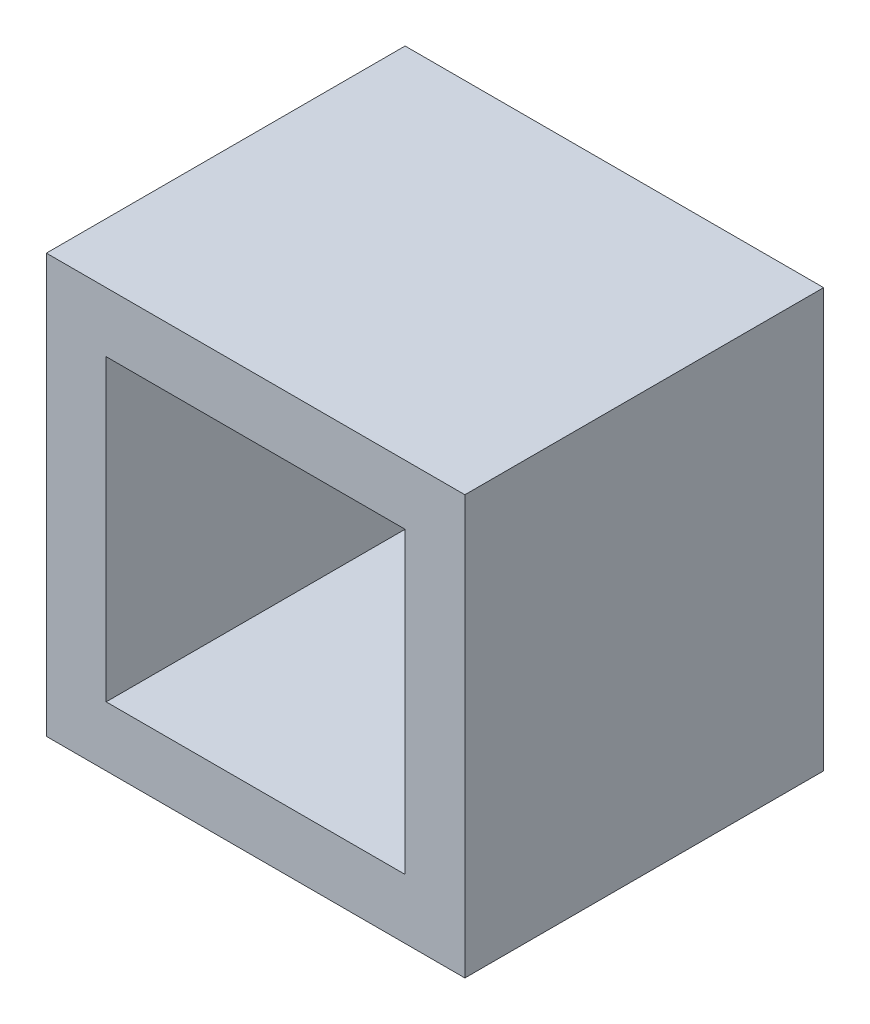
ISO-10303-21;
HEADER;
FILE_DESCRIPTION(('STEP AP214'),'2;1');
FILE_NAME('part.step','',(''),(''),'','','');
FILE_SCHEMA(('AUTOMOTIVE_DESIGN { 1 0 10303 214 1 1 1 1 }'));
ENDSEC;
DATA;
#1=APPLICATION_CONTEXT('core data for automotive mechanical design processes');
#2=APPLICATION_PROTOCOL_DEFINITION('international standard','automotive_design',2000,#1);
#3=PRODUCT_CONTEXT('',#1,'mechanical');
#4=PRODUCT('Part','Part','',(#3));
#5=PRODUCT_RELATED_PRODUCT_CATEGORY('part','',(#4));
#6=PRODUCT_DEFINITION_FORMATION('','',#4);
#7=PRODUCT_DEFINITION_CONTEXT('part definition',#1,'design');
#8=PRODUCT_DEFINITION('design','',#6,#7);
#9=PRODUCT_DEFINITION_SHAPE('','',#8);
#10=(LENGTH_UNIT() NAMED_UNIT(*) SI_UNIT(.MILLI.,.METRE.));
#11=(NAMED_UNIT(*) PLANE_ANGLE_UNIT() SI_UNIT($,.RADIAN.));
#12=(NAMED_UNIT(*) SI_UNIT($,.STERADIAN.) SOLID_ANGLE_UNIT());
#13=UNCERTAINTY_MEASURE_WITH_UNIT(LENGTH_MEASURE(1.E-05),#10,'distance_accuracy_value','');
#14=(GEOMETRIC_REPRESENTATION_CONTEXT(3) GLOBAL_UNCERTAINTY_ASSIGNED_CONTEXT((#13)) GLOBAL_UNIT_ASSIGNED_CONTEXT((#10,
#11,#12)) REPRESENTATION_CONTEXT('',''));
#15=CARTESIAN_POINT('',(0.,0.,0.));
#16=DIRECTION('',(0.,0.,1.));
#17=DIRECTION('',(1.,0.,0.));
#18=AXIS2_PLACEMENT_3D('',#15,#16,#17);
#19=CARTESIAN_POINT('',(0.,0.,60.));
#20=DIRECTION('',(0.,0.,1.));
#21=DIRECTION('',(1.,0.,0.));
#22=AXIS2_PLACEMENT_3D('',#19,#20,#21);
#23=PLANE('',#22);
#24=DIRECTION('',(0.,-1.,0.));
#25=VECTOR('',#24,1.);
#26=CARTESIAN_POINT('',(-35.,-35.,60.));
#27=LINE('',#26,#25);
#28=CARTESIAN_POINT('',(-35.,35.,60.));
#29=VERTEX_POINT('',#28);
#30=CARTESIAN_POINT('',(-35.,-35.,60.));
#31=VERTEX_POINT('',#30);
#32=EDGE_CURVE('E134',#29,#31,#27,.T.);
#33=ORIENTED_EDGE('',*,*,#32,.T.);
#34=DIRECTION('',(1.,0.,0.));
#35=VECTOR('',#34,1.);
#36=CARTESIAN_POINT('',(35.,-35.,60.));
#37=LINE('',#36,#35);
#38=CARTESIAN_POINT('',(35.,-35.,60.));
#39=VERTEX_POINT('',#38);
#40=EDGE_CURVE('E137',#31,#39,#37,.T.);
#41=ORIENTED_EDGE('',*,*,#40,.T.);
#42=DIRECTION('',(0.,1.,0.));
#43=VECTOR('',#42,1.);
#44=CARTESIAN_POINT('',(35.,-35.,60.));
#45=LINE('',#44,#43);
#46=CARTESIAN_POINT('',(35.,35.,60.));
#47=VERTEX_POINT('',#46);
#48=EDGE_CURVE('E140',#39,#47,#45,.T.);
#49=ORIENTED_EDGE('',*,*,#48,.T.);
#50=DIRECTION('',(-1.,0.,0.));
#51=VECTOR('',#50,1.);
#52=CARTESIAN_POINT('',(35.,35.,60.));
#53=LINE('',#52,#51);
#54=EDGE_CURVE('E142',#47,#29,#53,.T.);
#55=ORIENTED_EDGE('',*,*,#54,.T.);
#56=EDGE_LOOP('',(#33,#41,#49,#55));
#57=FACE_BOUND('',#56,.T.);
#58=DIRECTION('',(1.,0.,0.));
#59=VECTOR('',#58,1.);
#60=CARTESIAN_POINT('',(25.,-25.,60.));
#61=LINE('',#60,#59);
#62=CARTESIAN_POINT('',(-25.,-25.,60.));
#63=VERTEX_POINT('',#62);
#64=CARTESIAN_POINT('',(25.,-25.,60.));
#65=VERTEX_POINT('',#64);
#66=EDGE_CURVE('E106',#63,#65,#61,.T.);
#67=ORIENTED_EDGE('',*,*,#66,.F.);
#68=DIRECTION('',(0.,-1.,0.));
#69=VECTOR('',#68,1.);
#70=CARTESIAN_POINT('',(-25.,-25.,60.));
#71=LINE('',#70,#69);
#72=CARTESIAN_POINT('',(-25.,25.,60.));
#73=VERTEX_POINT('',#72);
#74=EDGE_CURVE('E98',#73,#63,#71,.T.);
#75=ORIENTED_EDGE('',*,*,#74,.F.);
#76=DIRECTION('',(-1.,0.,0.));
#77=VECTOR('',#76,1.);
#78=CARTESIAN_POINT('',(25.,25.,60.));
#79=LINE('',#78,#77);
#80=CARTESIAN_POINT('',(25.,25.,60.));
#81=VERTEX_POINT('',#80);
#82=EDGE_CURVE('E120',#81,#73,#79,.T.);
#83=ORIENTED_EDGE('',*,*,#82,.F.);
#84=DIRECTION('',(0.,1.,0.));
#85=VECTOR('',#84,1.);
#86=CARTESIAN_POINT('',(25.,-25.,60.));
#87=LINE('',#86,#85);
#88=EDGE_CURVE('E118',#65,#81,#87,.T.);
#89=ORIENTED_EDGE('',*,*,#88,.F.);
#90=EDGE_LOOP('',(#67,#75,#83,#89));
#91=FACE_BOUND('',#90,.T.);
#92=ADVANCED_FACE('F33',(#57,#91),#23,.T.);
#93=CARTESIAN_POINT('',(0.,0.,0.));
#94=DIRECTION('',(0.,0.,1.));
#95=DIRECTION('',(1.,0.,0.));
#96=AXIS2_PLACEMENT_3D('',#93,#94,#95);
#97=PLANE('',#96);
#98=DIRECTION('',(0.,-1.,0.));
#99=VECTOR('',#98,1.);
#100=CARTESIAN_POINT('',(-35.,-35.,0.));
#101=LINE('',#100,#99);
#102=CARTESIAN_POINT('',(-35.,35.,0.));
#103=VERTEX_POINT('',#102);
#104=CARTESIAN_POINT('',(-35.,-35.,0.));
#105=VERTEX_POINT('',#104);
#106=EDGE_CURVE('E114',#103,#105,#101,.T.);
#107=ORIENTED_EDGE('',*,*,#106,.F.);
#108=DIRECTION('',(-1.,0.,0.));
#109=VECTOR('',#108,1.);
#110=CARTESIAN_POINT('',(35.,35.,0.));
#111=LINE('',#110,#109);
#112=CARTESIAN_POINT('',(35.,35.,0.));
#113=VERTEX_POINT('',#112);
#114=EDGE_CURVE('E138',#113,#103,#111,.T.);
#115=ORIENTED_EDGE('',*,*,#114,.F.);
#116=DIRECTION('',(0.,1.,0.));
#117=VECTOR('',#116,1.);
#118=CARTESIAN_POINT('',(35.,-35.,0.));
#119=LINE('',#118,#117);
#120=CARTESIAN_POINT('',(35.,-35.,0.));
#121=VERTEX_POINT('',#120);
#122=EDGE_CURVE('E149',#121,#113,#119,.T.);
#123=ORIENTED_EDGE('',*,*,#122,.F.);
#124=DIRECTION('',(1.,0.,0.));
#125=VECTOR('',#124,1.);
#126=CARTESIAN_POINT('',(35.,-35.,0.));
#127=LINE('',#126,#125);
#128=EDGE_CURVE('E147',#105,#121,#127,.T.);
#129=ORIENTED_EDGE('',*,*,#128,.F.);
#130=EDGE_LOOP('',(#107,#115,#123,#129));
#131=FACE_BOUND('',#130,.T.);
#132=DIRECTION('',(0.,-1.,0.));
#133=VECTOR('',#132,1.);
#134=CARTESIAN_POINT('',(-25.,-25.,0.));
#135=LINE('',#134,#133);
#136=CARTESIAN_POINT('',(-25.,25.,0.));
#137=VERTEX_POINT('',#136);
#138=CARTESIAN_POINT('',(-25.,-25.,0.));
#139=VERTEX_POINT('',#138);
#140=EDGE_CURVE('E56',#137,#139,#135,.T.);
#141=ORIENTED_EDGE('',*,*,#140,.T.);
#142=DIRECTION('',(1.,0.,0.));
#143=VECTOR('',#142,1.);
#144=CARTESIAN_POINT('',(25.,-25.,0.));
#145=LINE('',#144,#143);
#146=CARTESIAN_POINT('',(25.,-25.,0.));
#147=VERTEX_POINT('',#146);
#148=EDGE_CURVE('E113',#139,#147,#145,.T.);
#149=ORIENTED_EDGE('',*,*,#148,.T.);
#150=DIRECTION('',(0.,1.,0.));
#151=VECTOR('',#150,1.);
#152=CARTESIAN_POINT('',(25.,-25.,0.));
#153=LINE('',#152,#151);
#154=CARTESIAN_POINT('',(25.,25.,0.));
#155=VERTEX_POINT('',#154);
#156=EDGE_CURVE('E126',#147,#155,#153,.T.);
#157=ORIENTED_EDGE('',*,*,#156,.T.);
#158=DIRECTION('',(-1.,0.,0.));
#159=VECTOR('',#158,1.);
#160=CARTESIAN_POINT('',(25.,25.,0.));
#161=LINE('',#160,#159);
#162=EDGE_CURVE('E107',#155,#137,#161,.T.);
#163=ORIENTED_EDGE('',*,*,#162,.T.);
#164=EDGE_LOOP('',(#141,#149,#157,#163));
#165=FACE_BOUND('',#164,.T.);
#166=ADVANCED_FACE('F167',(#131,#165),#97,.F.);
#167=CARTESIAN_POINT('',(-35.,-35.,60.));
#168=DIRECTION('',(1.,0.,0.));
#169=DIRECTION('',(0.,0.,-1.));
#170=AXIS2_PLACEMENT_3D('',#167,#168,#169);
#171=PLANE('',#170);
#172=ORIENTED_EDGE('',*,*,#106,.T.);
#173=DIRECTION('',(0.,0.,-1.));
#174=VECTOR('',#173,1.);
#175=CARTESIAN_POINT('',(-35.,-35.,60.));
#176=LINE('',#175,#174);
#177=EDGE_CURVE('E11',#31,#105,#176,.T.);
#178=ORIENTED_EDGE('',*,*,#177,.F.);
#179=ORIENTED_EDGE('',*,*,#32,.F.);
#180=DIRECTION('',(0.,0.,-1.));
#181=VECTOR('',#180,1.);
#182=CARTESIAN_POINT('',(-35.,35.,60.));
#183=LINE('',#182,#181);
#184=EDGE_CURVE('E144',#29,#103,#183,.T.);
#185=ORIENTED_EDGE('',*,*,#184,.T.);
#186=EDGE_LOOP('',(#172,#178,#179,#185));
#187=FACE_BOUND('',#186,.T.);
#188=ADVANCED_FACE('F35',(#187),#171,.F.);
#189=CARTESIAN_POINT('',(35.,-35.,60.));
#190=DIRECTION('',(0.,1.,0.));
#191=DIRECTION('',(-1.,0.,0.));
#192=AXIS2_PLACEMENT_3D('',#189,#190,#191);
#193=PLANE('',#192);
#194=ORIENTED_EDGE('',*,*,#128,.T.);
#195=DIRECTION('',(0.,0.,-1.));
#196=VECTOR('',#195,1.);
#197=CARTESIAN_POINT('',(35.,-35.,60.));
#198=LINE('',#197,#196);
#199=EDGE_CURVE('E41',#39,#121,#198,.T.);
#200=ORIENTED_EDGE('',*,*,#199,.F.);
#201=ORIENTED_EDGE('',*,*,#40,.F.);
#202=ORIENTED_EDGE('',*,*,#177,.T.);
#203=EDGE_LOOP('',(#194,#200,#201,#202));
#204=FACE_BOUND('',#203,.T.);
#205=ADVANCED_FACE('F177',(#204),#193,.F.);
#206=CARTESIAN_POINT('',(35.,-35.,60.));
#207=DIRECTION('',(-1.,0.,0.));
#208=DIRECTION('',(0.,0.,1.));
#209=AXIS2_PLACEMENT_3D('',#206,#207,#208);
#210=PLANE('',#209);
#211=ORIENTED_EDGE('',*,*,#122,.T.);
#212=DIRECTION('',(0.,0.,-1.));
#213=VECTOR('',#212,1.);
#214=CARTESIAN_POINT('',(35.,35.,60.));
#215=LINE('',#214,#213);
#216=EDGE_CURVE('E154',#47,#113,#215,.T.);
#217=ORIENTED_EDGE('',*,*,#216,.F.);
#218=ORIENTED_EDGE('',*,*,#48,.F.);
#219=ORIENTED_EDGE('',*,*,#199,.T.);
#220=EDGE_LOOP('',(#211,#217,#218,#219));
#221=FACE_BOUND('',#220,.T.);
#222=ADVANCED_FACE('F161',(#221),#210,.F.);
#223=CARTESIAN_POINT('',(35.,35.,60.));
#224=DIRECTION('',(0.,-1.,0.));
#225=DIRECTION('',(1.,0.,0.));
#226=AXIS2_PLACEMENT_3D('',#223,#224,#225);
#227=PLANE('',#226);
#228=ORIENTED_EDGE('',*,*,#114,.T.);
#229=ORIENTED_EDGE('',*,*,#184,.F.);
#230=ORIENTED_EDGE('',*,*,#54,.F.);
#231=ORIENTED_EDGE('',*,*,#216,.T.);
#232=EDGE_LOOP('',(#228,#229,#230,#231));
#233=FACE_BOUND('',#232,.T.);
#234=ADVANCED_FACE('F171',(#233),#227,.F.);
#235=CARTESIAN_POINT('',(-25.,-25.,60.));
#236=DIRECTION('',(1.,0.,0.));
#237=DIRECTION('',(0.,0.,-1.));
#238=AXIS2_PLACEMENT_3D('',#235,#236,#237);
#239=PLANE('',#238);
#240=ORIENTED_EDGE('',*,*,#140,.F.);
#241=DIRECTION('',(0.,0.,-1.));
#242=VECTOR('',#241,1.);
#243=CARTESIAN_POINT('',(-25.,25.,60.));
#244=LINE('',#243,#242);
#245=EDGE_CURVE('E102',#73,#137,#244,.T.);
#246=ORIENTED_EDGE('',*,*,#245,.F.);
#247=ORIENTED_EDGE('',*,*,#74,.T.);
#248=DIRECTION('',(0.,0.,-1.));
#249=VECTOR('',#248,1.);
#250=CARTESIAN_POINT('',(-25.,-25.,60.));
#251=LINE('',#250,#249);
#252=EDGE_CURVE('E101',#63,#139,#251,.T.);
#253=ORIENTED_EDGE('',*,*,#252,.T.);
#254=EDGE_LOOP('',(#240,#246,#247,#253));
#255=FACE_BOUND('',#254,.T.);
#256=ADVANCED_FACE('F100',(#255),#239,.T.);
#257=CARTESIAN_POINT('',(25.,-25.,60.));
#258=DIRECTION('',(0.,1.,0.));
#259=DIRECTION('',(-1.,0.,0.));
#260=AXIS2_PLACEMENT_3D('',#257,#258,#259);
#261=PLANE('',#260);
#262=ORIENTED_EDGE('',*,*,#148,.F.);
#263=ORIENTED_EDGE('',*,*,#252,.F.);
#264=ORIENTED_EDGE('',*,*,#66,.T.);
#265=DIRECTION('',(0.,0.,-1.));
#266=VECTOR('',#265,1.);
#267=CARTESIAN_POINT('',(25.,-25.,60.));
#268=LINE('',#267,#266);
#269=EDGE_CURVE('E115',#65,#147,#268,.T.);
#270=ORIENTED_EDGE('',*,*,#269,.T.);
#271=EDGE_LOOP('',(#262,#263,#264,#270));
#272=FACE_BOUND('',#271,.T.);
#273=ADVANCED_FACE('F110',(#272),#261,.T.);
#274=CARTESIAN_POINT('',(25.,-25.,60.));
#275=DIRECTION('',(-1.,0.,0.));
#276=DIRECTION('',(0.,0.,1.));
#277=AXIS2_PLACEMENT_3D('',#274,#275,#276);
#278=PLANE('',#277);
#279=ORIENTED_EDGE('',*,*,#156,.F.);
#280=ORIENTED_EDGE('',*,*,#269,.F.);
#281=ORIENTED_EDGE('',*,*,#88,.T.);
#282=DIRECTION('',(0.,0.,-1.));
#283=VECTOR('',#282,1.);
#284=CARTESIAN_POINT('',(25.,25.,60.));
#285=LINE('',#284,#283);
#286=EDGE_CURVE('E48',#81,#155,#285,.T.);
#287=ORIENTED_EDGE('',*,*,#286,.T.);
#288=EDGE_LOOP('',(#279,#280,#281,#287));
#289=FACE_BOUND('',#288,.T.);
#290=ADVANCED_FACE('F200',(#289),#278,.T.);
#291=CARTESIAN_POINT('',(25.,25.,60.));
#292=DIRECTION('',(0.,-1.,0.));
#293=DIRECTION('',(1.,0.,0.));
#294=AXIS2_PLACEMENT_3D('',#291,#292,#293);
#295=PLANE('',#294);
#296=ORIENTED_EDGE('',*,*,#162,.F.);
#297=ORIENTED_EDGE('',*,*,#286,.F.);
#298=ORIENTED_EDGE('',*,*,#82,.T.);
#299=ORIENTED_EDGE('',*,*,#245,.T.);
#300=EDGE_LOOP('',(#296,#297,#298,#299));
#301=FACE_BOUND('',#300,.T.);
#302=ADVANCED_FACE('F204',(#301),#295,.T.);
#303=CLOSED_SHELL('',(#92,#166,#188,#205,#222,#234,#256,#273,#290,#302));
#304=MANIFOLD_SOLID_BREP('B2',#303);
#305=ADVANCED_BREP_SHAPE_REPRESENTATION('',(#18,#304),#14);
#306=SHAPE_DEFINITION_REPRESENTATION(#9,#305);
ENDSEC;
END-ISO-10303-21;
